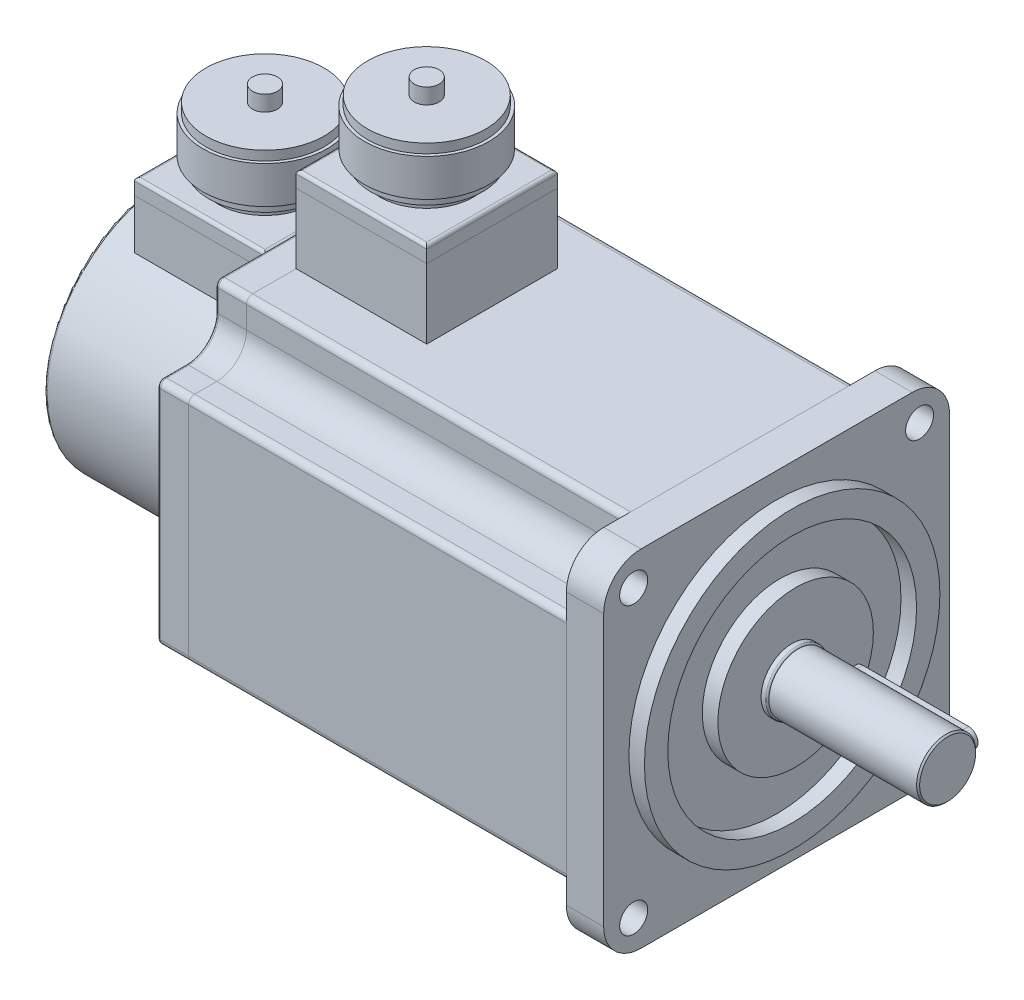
from build123d import *

# Parameters (mm, degrees)
EXTRUDE_1_DEPTH     = 10
EXTRUDE_2_DEPTH     = 121.5
EXTRUDE_3_DEPTH     = 12
CUT_EXTRUDE_1_DEPTH = 155
FILLET_1_R          = 1
SKETCH_7_R          = 4.5
CUT_EXTRUDE_2_DEPTH = 12
SKETCH_8_R          = 47.5
SKETCH_8_R_2        = 40
SKETCH_8_R_3        = 25
EXTRUDE_4_DEPTH     = 5
SKETCH_9_R          = 10
EXTRUDE_5_DEPTH     = 2
SKETCH_10_R         = 9.5
EXTRUDE_6_DEPTH     = 48
FILLET_2_R          = 0.5
CHAMFER_1_SIZE      = 0.5
SKETCH_13_R         = 40
EXTRUDE_8_DEPTH     = 52
SKETCH_14_W         = 42
SKETCH_14_H         = 42
CUT_EXTRUDE_4_DEPTH = 10
SKETCH_15_W         = 42
SKETCH_15_H         = 42
EXTRUDE_9_DEPTH     = 20
SKETCH_16_W         = 42
SKETCH_16_H         = 42
EXTRUDE_10_DEPTH    = 5
FILLET_3_R          = 1
SKETCH_17_R         = 15
EXTRUDE_11_DEPTH    = 3
SKETCH_18_R         = 18
EXTRUDE_12_DEPTH    = 3
SKETCH_19_R         = 20
EXTRUDE_13_DEPTH    = 12
SKETCH_20_R         = 19
EXTRUDE_14_DEPTH    = 3
SKETCH_21_R         = 4
EXTRUDE_15_DEPTH    = 5
SKETCH_22_W         = 42
SKETCH_22_H         = 42
EXTRUDE_16_DEPTH    = 22.4
SKETCH_23_W         = 42
SKETCH_23_H         = 42
EXTRUDE_17_DEPTH    = 5
FILLET_4_R          = 1
SKETCH_24_R         = 15
EXTRUDE_18_DEPTH    = 3
SKETCH_25_R         = 18
EXTRUDE_19_DEPTH    = 3
SKETCH_26_R         = 20
EXTRUDE_20_DEPTH    = 12
SKETCH_27_R         = 19
EXTRUDE_21_DEPTH    = 3
SKETCH_28_R         = 4
EXTRUDE_22_DEPTH    = 5
FILLET_5_R          = 1
CUT_EXTRUDE_5_DEPTH = 3.5
EXTRUDE_23_DEPTH    = 6


with BuildPart() as part:
    # Sketch 1 → Extrude 1 (new body)
    with BuildSketch(Plane(origin=(0, 0, 0), x_dir=(0, 0, -1), z_dir=(1, 0, 0))):
        with BuildLine():
            Line((-43.6, -55.6), (43.6, -55.6))
            ThreePointArc((43.6, -55.6), (52.085281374, -52.085281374), (55.6, -43.6))
            Line((55.6, -43.6), (55.6, 43.6))
            ThreePointArc((55.6, 43.6), (52.085281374, 52.085281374), (43.6, 55.6))
            Line((43.6, 55.6), (-43.6, 55.6))
            ThreePointArc((-43.6, 55.6), (-52.085281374, 52.085281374), (-55.6, 43.6))
            Line((-55.6, 43.6), (-55.6, -43.6))
            ThreePointArc((-55.6, -43.6), (-52.085281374, -52.085281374), (-43.6, -55.6))
        make_face()
    extrude(amount=EXTRUDE_1_DEPTH)


with BuildPart() as body_2:
    # Sketch 2 → Extrude 2 (new body)
    with BuildSketch(Plane(origin=(10, 0, 0), x_dir=(0, 0, -1), z_dir=(1, 0, 0))):
        with BuildLine():
            Line((-43.6, -55.6), (43.6, -55.6))
            ThreePointArc((43.6, -55.6), (52.085281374, -52.085281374), (55.6, -43.6))
            Line((55.6, -43.6), (55.6, 43.6))
            ThreePointArc((55.6, 43.6), (52.085281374, 52.085281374), (43.6, 55.6))
            Line((43.6, 55.6), (-43.6, 55.6))
            ThreePointArc((-43.6, 55.6), (-52.085281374, 52.085281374), (-55.6, 43.6))
            Line((-55.6, 43.6), (-55.6, -43.6))
            ThreePointArc((-55.6, -43.6), (-52.085281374, -52.085281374), (-43.6, -55.6))
        make_face()
    extrude(amount=EXTRUDE_2_DEPTH)


with BuildPart() as body_3:
    # Sketch 3 → Extrude 3 (new body)
    with BuildSketch(Plane(origin=(131.5, 0, 0), x_dir=(0, 0, -1), z_dir=(1, 0, 0))):
        with BuildLine():
            Line((-43.6, -55.6), (43.6, -55.6))
            ThreePointArc((43.6, -55.6), (52.085281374, -52.085281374), (55.6, -43.6))
            Line((55.6, -43.6), (55.6, 43.6))
            ThreePointArc((55.6, 43.6), (52.085281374, 52.085281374), (43.6, 55.6))
            Line((43.6, 55.6), (-43.6, 55.6))
            ThreePointArc((-43.6, 55.6), (-52.085281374, 52.085281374), (-55.6, 43.6))
            Line((-55.6, 43.6), (-55.6, -43.6))
            ThreePointArc((-55.6, -43.6), (-52.085281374, -52.085281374), (-43.6, -55.6))
        make_face()
    extrude(amount=EXTRUDE_3_DEPTH)

    # Sketch 7 → Cut-Extrude 2 (cut)
    with BuildSketch(Plane(origin=(143.5, 0, 0), x_dir=(0, 0, -1), z_dir=(1, 0, 0))):
        with Locations((-45.961940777, 45.961940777)):
            Circle(SKETCH_7_R)
        with Locations((45.961940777, 45.961940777)):
            Circle(SKETCH_7_R)
        with Locations((45.961940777, -45.961940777)):
            Circle(SKETCH_7_R)
        with Locations((-45.961940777, -45.961940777)):
            Circle(SKETCH_7_R)
    extrude(amount=-CUT_EXTRUDE_2_DEPTH, mode=Mode.SUBTRACT)

    # Sketch 8 → Extrude 4 (add)
    # profile 1 of 2: a face of its own
    with BuildSketch(Plane(origin=(143.5, 0, 0), x_dir=(0, 0, -1), z_dir=(1, 0, 0))):
        with Locations(Location((0, 0, 0), (0, 0, 180))):
            Circle(SKETCH_8_R)
        Circle(SKETCH_8_R_2, mode=Mode.SUBTRACT)
    # profile 2 of 2: a face of its own
    with BuildSketch(Plane(origin=(143.5, 0, 0), x_dir=(0, 0, -1), z_dir=(1, 0, 0))):
        with Locations(Location((1.103286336, 0, 0), (0, 0, 180))):
            Circle(SKETCH_8_R_3)
    extrude(amount=EXTRUDE_4_DEPTH)


with BuildPart() as cut_extrude_1_tool:
    # Sketch 6 → Cut-Extrude 1 (new body)
    with BuildSketch(Plane.ZY):
        with BuildLine():
            Line((-46.5, 36.949083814), (-53.6, 36.949083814))
            ThreePointArc((-53.6, 36.949083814), (-55.014213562, 36.363297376), (-55.6, 34.949083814))
            Line((-55.6, 34.949083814), (-55.6, 43.6))
            ThreePointArc((-55.6, 43.6), (-52.085281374, 52.085281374), (-43.6, 55.6))
            Line((-43.6, 55.6), (-34.949083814, 55.6))
            ThreePointArc((-34.949083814, 55.6), (-36.363297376, 55.014213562), (-36.949083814, 53.6))
            Line((-36.949083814, 53.6), (-36.949083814, 46.5))
            ThreePointArc((-36.949083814, 46.5), (-39.746482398, 39.746482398), (-46.5, 36.949083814))
        make_face()
        with BuildLine():
            Line((34.949083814, 55.6), (43.6, 55.6))
            ThreePointArc((43.6, 55.6), (52.085281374, 52.085281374), (55.6, 43.6))
            Line((55.6, 43.6), (55.6, 34.949083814))
            ThreePointArc((55.6, 34.949083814), (55.014213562, 36.363297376), (53.6, 36.949083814))
            Line((53.6, 36.949083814), (46.5, 36.949083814))
            ThreePointArc((46.5, 36.949083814), (39.746482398, 39.746482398), (36.949083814, 46.5))
            Line((36.949083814, 46.5), (36.949083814, 53.6))
            ThreePointArc((36.949083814, 53.6), (36.363297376, 55.014213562), (34.949083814, 55.6))
        make_face()
        with BuildLine():
            Line((-53.6, -36.949083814), (-46.5, -36.949083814))
            ThreePointArc((-46.5, -36.949083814), (-39.746482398, -39.746482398), (-36.949083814, -46.5))
            Line((-36.949083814, -46.5), (-36.949083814, -53.6))
            ThreePointArc((-36.949083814, -53.6), (-36.363297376, -55.014213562), (-34.949083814, -55.6))
            Line((-34.949083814, -55.6), (-43.6, -55.6))
            ThreePointArc((-43.6, -55.6), (-52.085281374, -52.085281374), (-55.6, -43.6))
            Line((-55.6, -43.6), (-55.6, -34.949083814))
            ThreePointArc((-55.6, -34.949083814), (-55.014213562, -36.363297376), (-53.6, -36.949083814))
        make_face()
        with BuildLine():
            Line((55.6, -34.949083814), (55.6, -43.6))
            ThreePointArc((55.6, -43.6), (52.085281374, -52.085281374), (43.6, -55.6))
            Line((43.6, -55.6), (34.949083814, -55.6))
            ThreePointArc((34.949083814, -55.6), (36.363297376, -55.014213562), (36.949083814, -53.6))
            Line((36.949083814, -53.6), (36.949083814, -46.5))
            ThreePointArc((36.949083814, -46.5), (39.746482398, -39.746482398), (46.5, -36.949083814))
            Line((46.5, -36.949083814), (53.6, -36.949083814))
            ThreePointArc((53.6, -36.949083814), (55.014213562, -36.363297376), (55.6, -34.949083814))
        make_face()
    extrude(amount=-CUT_EXTRUDE_1_DEPTH)


with BuildPart() as part_1:
    add(part.part)

    # Cut-Extrude 1: cut by cut_extrude_1_tool
    add(cut_extrude_1_tool.part, mode=Mode.SUBTRACT)

    # Fillet 1
    fillet_1_edges = [part_1.edges().sort_by_distance(p)[0] for p in [
        (0, 39.746482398, 39.746482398),
        (0, 36.949083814, 50.05),
        (0, 36.363297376, 55.014213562),
        (0, 55.014213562, 36.363297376),
        (0, 50.05, 36.949083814),
        (0, 0, 55.6),
        (0, 55.6, 0),
        (0, 0, -55.6),
        (0, -55.6, 0),
        (0, 55.014213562, -36.363297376),
        (0, 36.363297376, -55.014213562),
        (0, 36.949083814, -50.05),
        (0, 39.746482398, -39.746482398),
        (0, 50.05, -36.949083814),
        (0, -39.746482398, -39.746482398),
        (0, -36.949083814, -50.05),
        (0, -36.363297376, -55.014213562),
        (0, -55.014213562, -36.363297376),
        (0, -50.05, -36.949083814),
        (0, -39.746482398, 39.746482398),
        (0, -50.05, 36.949083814),
        (0, -55.014213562, 36.363297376),
        (0, -36.363297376, 55.014213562),
        (0, -36.949083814, 50.05),
    ]]
    fillet(fillet_1_edges, radius=FILLET_1_R)



with BuildPart() as body_2_1:
    add(body_2.part)

    # Cut-Extrude 1: cut by cut_extrude_1_tool
    add(cut_extrude_1_tool.part, mode=Mode.SUBTRACT)


with BuildPart() as body_4:
    # Sketch 9 → Extrude 5 (new body)
    with BuildSketch(Plane(origin=(148.5, 0, 0), x_dir=(0, 0, -1), z_dir=(1, 0, 0))):
        Circle(SKETCH_9_R)
    extrude(amount=EXTRUDE_5_DEPTH)

    # Fillet 2
    fillet_2_edges = [body_4.edges().sort_by_distance(p)[0] for p in [
        (150.5, 0, 10),
    ]]
    fillet(fillet_2_edges, radius=FILLET_2_R)


with BuildPart() as body_5:
    # Sketch 10 → Extrude 6 (new body)
    with BuildSketch(Plane(origin=(150.5, 0, 0), x_dir=(0, 0, -1), z_dir=(1, 0, 0))):
        Circle(SKETCH_10_R)
    extrude(amount=EXTRUDE_6_DEPTH)

    # Chamfer 1
    chamfer_1_edges = [body_5.edges().sort_by_distance(p)[0] for p in [
        (198.5, 0, 9.5),
    ]]
    chamfer(chamfer_1_edges, length=CHAMFER_1_SIZE)

    # Sketch 11 → Cut-Extrude 5 (cut)
    with BuildSketch(Plane.XY.offset(-9.75)):
        with BuildLine():
            Line((193, 3), (159, 3))
            ThreePointArc((159, 3), (156, 0), (159, -3))
            Line((159, -3), (193, -3))
            ThreePointArc((193, -3), (196, 0), (193, 3))
        make_face()
    extrude(amount=CUT_EXTRUDE_5_DEPTH, mode=Mode.SUBTRACT)


with BuildPart() as body_6:
    # Sketch 13 → Extrude 8 (new body)
    with BuildSketch(Plane.ZY):
        with Locations(Location((0, 0, 0), (0, 0, 180))):
            Circle(SKETCH_13_R)
    extrude(amount=EXTRUDE_8_DEPTH)

    # Sketch 14 → Cut-Extrude 4 (cut)
    with BuildSketch(Plane(origin=(0, 40, 0), x_dir=(1, 0, 0), z_dir=(0, 1, 0))):
        with Locations((-21, 0)):
            Rectangle(SKETCH_14_W, SKETCH_14_H)
    extrude(amount=-CUT_EXTRUDE_4_DEPTH, mode=Mode.SUBTRACT)


with BuildPart() as part_2:
    add(part_1.part)

    add(body_6.part)  # Extrude 9 merges body 6
    # Sketch 15 → Extrude 9 (add)
    with BuildSketch(Plane(origin=(0, 30, 0), x_dir=(1, 0, 0), z_dir=(0, 1, 0))):
        with Locations((-21, 0)):
            Rectangle(SKETCH_15_W, SKETCH_15_H)
    extrude(amount=EXTRUDE_9_DEPTH)

    # Fillet 5
    fillet_5_edges = [part_2.edges().sort_by_distance(p)[0] for p in [
        (-52, 0, 40),
    ]]
    fillet(fillet_5_edges, radius=FILLET_5_R)


with BuildPart() as body_6_2:
    # Sketch 16 → Extrude 10 (new body)
    with BuildSketch(Plane(origin=(0, 50, 0), x_dir=(1, 0, 0), z_dir=(0, 1, 0))):
        with Locations((-21, 0)):
            Rectangle(SKETCH_16_W, SKETCH_16_H)
    extrude(amount=EXTRUDE_10_DEPTH)

    # Fillet 3
    fillet_3_edges = [body_6_2.edges().sort_by_distance(p)[0] for p in [
        (-42, 55, 0),
        (-21, 55, 21),
        (0, 55, 0),
        (-21, 55, -21),
    ]]
    fillet(fillet_3_edges, radius=FILLET_3_R)


with BuildPart() as body_7:
    # Sketch 17 → Extrude 11 (new body)
    with BuildSketch(Plane(origin=(0, 55, 0), x_dir=(1, 0, 0), z_dir=(0, 1, 0))):
        with Locations(Location((-21, 0, 0), (0, 0, 270))):
            Circle(SKETCH_17_R)
    extrude(amount=EXTRUDE_11_DEPTH)

    # Sketch 18 → Extrude 12 (add)
    with BuildSketch(Plane(origin=(0, 58, 0), x_dir=(1, 0, 0), z_dir=(0, 1, 0))):
        with Locations(Location((-21, 0, 0), (0, 0, 270))):
            Circle(SKETCH_18_R)
    extrude(amount=EXTRUDE_12_DEPTH)

    # Sketch 19 → Extrude 13 (add)
    with BuildSketch(Plane(origin=(0, 61, 0), x_dir=(1, 0, 0), z_dir=(0, 1, 0))):
        with Locations(Location((-21, 0, 0), (0, 0, 270))):
            Circle(SKETCH_19_R)
    extrude(amount=EXTRUDE_13_DEPTH)

    # Sketch 20 → Extrude 14 (add)
    with BuildSketch(Plane(origin=(0, 73, 0), x_dir=(1, 0, 0), z_dir=(0, 1, 0))):
        with Locations(Location((-21, 0, 0), (0, 0, 270))):
            Circle(SKETCH_20_R)
    extrude(amount=EXTRUDE_14_DEPTH)

    # Sketch 21 → Extrude 15 (add)
    with BuildSketch(Plane(origin=(0, 76, 0), x_dir=(1, 0, 0), z_dir=(0, 1, 0))):
        with Locations(Location((-21, 0, 0), (0, 0, 270))):
            Circle(SKETCH_21_R)
    extrude(amount=EXTRUDE_15_DEPTH)


with BuildPart() as body_8:
    # Sketch 22 → Extrude 16 (new body)
    with BuildSketch(Plane(origin=(0, 55.6, 0), x_dir=(1, 0, 0), z_dir=(0, 1, 0))):
        with Locations((31, 0)):
            Rectangle(SKETCH_22_W, SKETCH_22_H)
    extrude(amount=EXTRUDE_16_DEPTH)


with BuildPart() as body_9:
    # Sketch 23 → Extrude 17 (new body)
    with BuildSketch(Plane(origin=(0, 78, 0), x_dir=(1, 0, 0), z_dir=(0, 1, 0))):
        with Locations((31, 0)):
            Rectangle(SKETCH_23_W, SKETCH_23_H)
    extrude(amount=EXTRUDE_17_DEPTH)

    # Fillet 4
    fillet_4_edges = [body_9.edges().sort_by_distance(p)[0] for p in [
        (10, 83, 0),
        (31, 83, 21),
        (52, 83, 0),
        (31, 83, -21),
    ]]
    fillet(fillet_4_edges, radius=FILLET_4_R)


with BuildPart() as body_10:
    # Sketch 24 → Extrude 18 (new body)
    with BuildSketch(Plane(origin=(0, 83, 0), x_dir=(1, 0, 0), z_dir=(0, 1, 0))):
        with Locations(Location((31, 0, 0), (0, 0, 270))):
            Circle(SKETCH_24_R)
    extrude(amount=EXTRUDE_18_DEPTH)


with BuildPart() as body_11:
    # Sketch 25 → Extrude 19 (new body)
    with BuildSketch(Plane(origin=(0, 86, 0), x_dir=(1, 0, 0), z_dir=(0, 1, 0))):
        with Locations(Location((31, 0, 0), (0, 0, 270))):
            Circle(SKETCH_25_R)
    extrude(amount=EXTRUDE_19_DEPTH)


with BuildPart() as body_12:
    # Sketch 26 → Extrude 20 (new body)
    with BuildSketch(Plane(origin=(0, 89, 0), x_dir=(1, 0, 0), z_dir=(0, 1, 0))):
        with Locations(Location((31, 0, 0), (0, 0, 270))):
            Circle(SKETCH_26_R)
    extrude(amount=EXTRUDE_20_DEPTH)


with BuildPart() as body_13:
    # Sketch 27 → Extrude 21 (new body)
    with BuildSketch(Plane(origin=(0, 101, 0), x_dir=(1, 0, 0), z_dir=(0, 1, 0))):
        with Locations(Location((31, 0, 0), (0, 0, 270))):
            Circle(SKETCH_27_R)
    extrude(amount=EXTRUDE_21_DEPTH)


with BuildPart() as body_14:
    # Sketch 28 → Extrude 22 (new body)
    with BuildSketch(Plane(origin=(0, 104, 0), x_dir=(1, 0, 0), z_dir=(0, 1, 0))):
        with Locations(Location((31, 0, 0), (0, 0, 270))):
            Circle(SKETCH_28_R)
    extrude(amount=EXTRUDE_22_DEPTH)


with BuildPart() as body_15:
    # Sketch 30 → Extrude 23 (new body)
    with BuildSketch(Plane(origin=(0, 0, -6.25), x_dir=(-1, 0, 0), z_dir=(0, 0, -1))):
        with BuildLine():
            Line((-193, 3), (-159, 3))
            ThreePointArc((-159, 3), (-156, 0), (-159, -3))
            Line((-159, -3), (-193, -3))
            ThreePointArc((-193, -3), (-196, 0), (-193, 3))
        make_face()
    extrude(amount=EXTRUDE_23_DEPTH)


solid = Compound([body_3.part, body_2_1.part, body_4.part, body_5.part, part_2.part, body_6_2.part, body_7.part, body_8.part, body_9.part, body_10.part, body_11.part, body_12.part, body_13.part, body_14.part, body_15.part])
